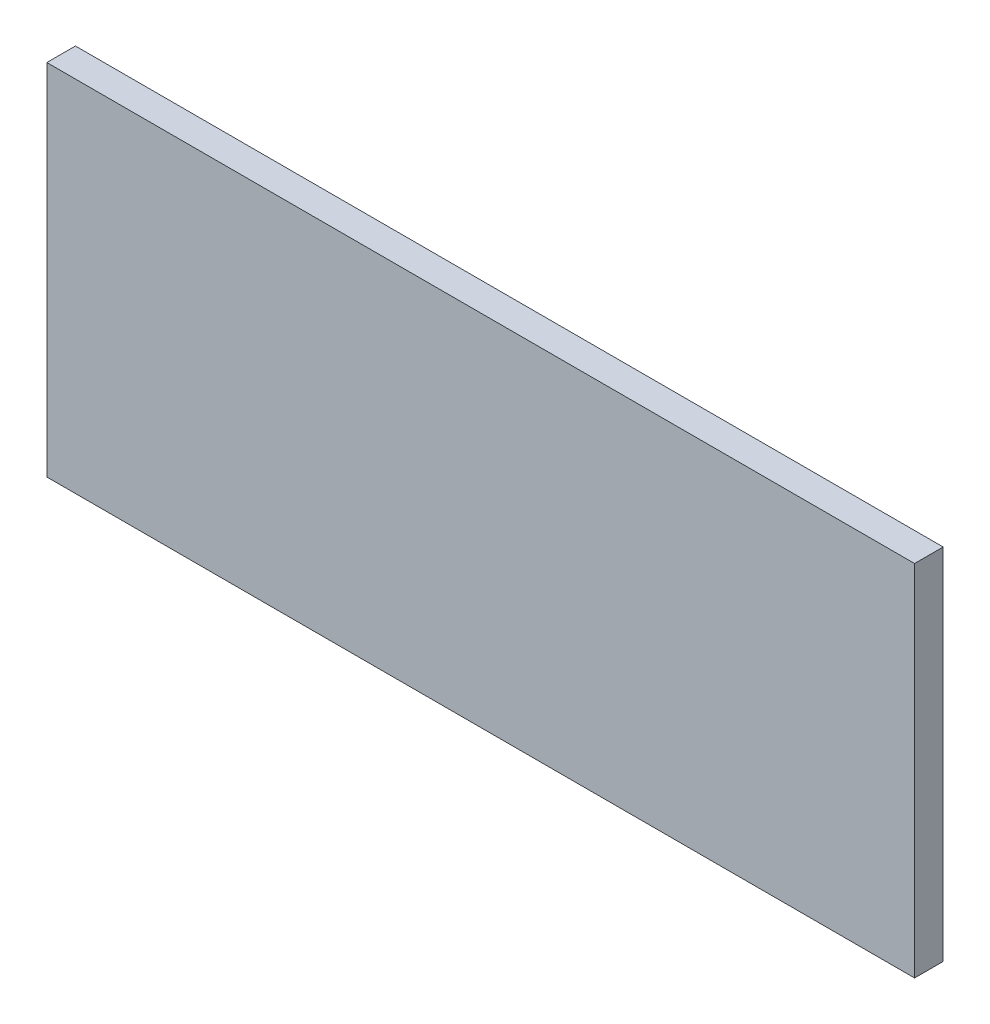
from build123d import *

# Parameters (mm, degrees)
BOSS_EXTRUDE2_DEPTH = 38.1


with BuildPart() as part:
    # 3DSketch1 → Boss-Extrude2 (new body)
    with BuildSketch(Plane(origin=(-406.4, -2538.877343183, 0), x_dir=(0.9240540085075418, 0.38226193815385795, -1.643616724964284e-15), z_dir=(0, 0, 1))):
        Polygon((0, 0), (1067.929217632, -441.780121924), (1250.684472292, 0), (182.75525466, 441.780121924), align=None)
    extrude(amount=BOSS_EXTRUDE2_DEPTH)


solid = part.part
